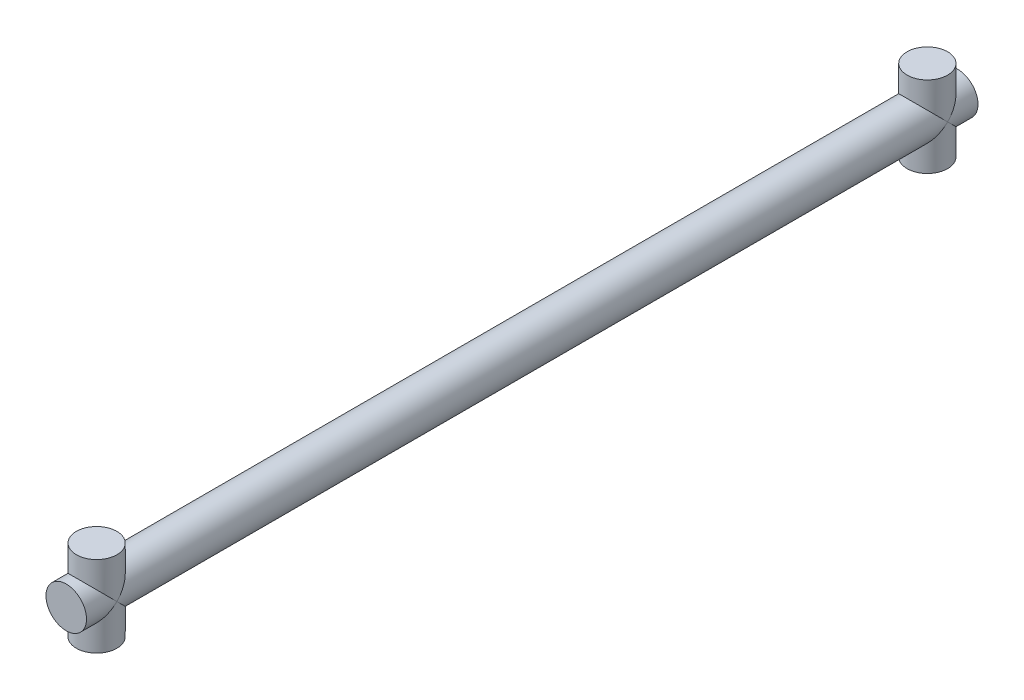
ISO-10303-21;
HEADER;
FILE_DESCRIPTION(('STEP AP214'),'2;1');
FILE_NAME('part.step','',(''),(''),'','','');
FILE_SCHEMA(('AUTOMOTIVE_DESIGN { 1 0 10303 214 1 1 1 1 }'));
ENDSEC;
DATA;
#1=APPLICATION_CONTEXT('core data for automotive mechanical design processes');
#2=APPLICATION_PROTOCOL_DEFINITION('international standard','automotive_design',2000,#1);
#3=PRODUCT_CONTEXT('',#1,'mechanical');
#4=PRODUCT('Part','Part','',(#3));
#5=PRODUCT_RELATED_PRODUCT_CATEGORY('part','',(#4));
#6=PRODUCT_DEFINITION_FORMATION('','',#4);
#7=PRODUCT_DEFINITION_CONTEXT('part definition',#1,'design');
#8=PRODUCT_DEFINITION('design','',#6,#7);
#9=PRODUCT_DEFINITION_SHAPE('','',#8);
#10=(LENGTH_UNIT() NAMED_UNIT(*) SI_UNIT(.MILLI.,.METRE.));
#11=(NAMED_UNIT(*) PLANE_ANGLE_UNIT() SI_UNIT($,.RADIAN.));
#12=(NAMED_UNIT(*) SI_UNIT($,.STERADIAN.) SOLID_ANGLE_UNIT());
#13=UNCERTAINTY_MEASURE_WITH_UNIT(LENGTH_MEASURE(1.E-05),#10,'distance_accuracy_value','');
#14=(GEOMETRIC_REPRESENTATION_CONTEXT(3) GLOBAL_UNCERTAINTY_ASSIGNED_CONTEXT((#13)) GLOBAL_UNIT_ASSIGNED_CONTEXT((#10,
#11,#12)) REPRESENTATION_CONTEXT('',''));
#15=CARTESIAN_POINT('',(0.,0.,0.));
#16=DIRECTION('',(0.,0.,1.));
#17=DIRECTION('',(1.,0.,0.));
#18=AXIS2_PLACEMENT_3D('',#15,#16,#17);
#19=CARTESIAN_POINT('',(0.,0.,55.));
#20=DIRECTION('',(0.,0.,-1.));
#21=DIRECTION('',(-1.,0.,0.));
#22=AXIS2_PLACEMENT_3D('',#19,#20,#21);
#23=CYLINDRICAL_SURFACE('',#22,2.5);
#24=CARTESIAN_POINT('',(0.,0.,-51.25));
#25=DIRECTION('',(0.,-0.707106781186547,-0.707106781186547));
#26=DIRECTION('',(0.,0.707106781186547,-0.707106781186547));
#27=AXIS2_PLACEMENT_3D('',#24,#25,#26);
#28=ELLIPSE('',#27,3.53553390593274,2.5);
#29=CARTESIAN_POINT('',(2.5,0.,-51.25));
#30=VERTEX_POINT('',#29);
#31=CARTESIAN_POINT('',(-2.5,0.,-51.25));
#32=VERTEX_POINT('',#31);
#33=EDGE_CURVE('E68',#30,#32,#28,.T.);
#34=ORIENTED_EDGE('',*,*,#33,.F.);
#35=CARTESIAN_POINT('',(0.,0.,-51.25));
#36=DIRECTION('',(0.,0.707106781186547,-0.707106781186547));
#37=DIRECTION('',(0.,-0.707106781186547,-0.707106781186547));
#38=AXIS2_PLACEMENT_3D('',#35,#36,#37);
#39=ELLIPSE('',#38,3.53553390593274,2.5);
#40=EDGE_CURVE('E64',#32,#30,#39,.T.);
#41=ORIENTED_EDGE('',*,*,#40,.F.);
#42=EDGE_LOOP('',(#34,#41));
#43=FACE_BOUND('',#42,.T.);
#44=CARTESIAN_POINT('',(0.,0.,51.25));
#45=DIRECTION('',(0.,-0.707106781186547,-0.707106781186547));
#46=DIRECTION('',(0.,0.707106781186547,-0.707106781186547));
#47=AXIS2_PLACEMENT_3D('',#44,#45,#46);
#48=ELLIPSE('',#47,3.53553390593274,2.5);
#49=CARTESIAN_POINT('',(2.5,0.,51.25));
#50=VERTEX_POINT('',#49);
#51=CARTESIAN_POINT('',(-2.5,0.,51.25));
#52=VERTEX_POINT('',#51);
#53=EDGE_CURVE('E11',#50,#52,#48,.F.);
#54=ORIENTED_EDGE('',*,*,#53,.F.);
#55=CARTESIAN_POINT('',(0.,0.,51.25));
#56=DIRECTION('',(0.,0.707106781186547,-0.707106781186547));
#57=DIRECTION('',(0.,-0.707106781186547,-0.707106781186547));
#58=AXIS2_PLACEMENT_3D('',#55,#56,#57);
#59=ELLIPSE('',#58,3.53553390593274,2.5);
#60=EDGE_CURVE('E48',#52,#50,#59,.F.);
#61=ORIENTED_EDGE('',*,*,#60,.F.);
#62=EDGE_LOOP('',(#54,#61));
#63=FACE_BOUND('',#62,.T.);
#64=ADVANCED_FACE('F34',(#43,#63),#23,.T.);
#65=CARTESIAN_POINT('',(0.,-5.,-51.25));
#66=DIRECTION('',(0.,1.,0.));
#67=DIRECTION('',(0.,0.,1.));
#68=AXIS2_PLACEMENT_3D('',#65,#66,#67);
#69=PLANE('',#68);
#70=CARTESIAN_POINT('',(0.,-5.,-51.25));
#71=DIRECTION('',(0.,1.,0.));
#72=DIRECTION('',(0.,0.,1.));
#73=AXIS2_PLACEMENT_3D('',#70,#71,#72);
#74=CIRCLE('',#73,2.5);
#75=CARTESIAN_POINT('',(0.,-5.,-48.75));
#76=VERTEX_POINT('',#75);
#77=EDGE_CURVE('E118',#76,#76,#74,.T.);
#78=ORIENTED_EDGE('',*,*,#77,.F.);
#79=EDGE_LOOP('',(#78));
#80=FACE_BOUND('',#79,.T.);
#81=ADVANCED_FACE('F89',(#80),#69,.F.);
#82=CARTESIAN_POINT('',(0.,5.,-51.25));
#83=DIRECTION('',(0.,-1.,0.));
#84=DIRECTION('',(0.,0.,-1.));
#85=AXIS2_PLACEMENT_3D('',#82,#83,#84);
#86=CYLINDRICAL_SURFACE('',#85,2.5);
#87=ORIENTED_EDGE('',*,*,#77,.T.);
#88=EDGE_LOOP('',(#87));
#89=FACE_BOUND('',#88,.T.);
#90=CARTESIAN_POINT('',(0.,0.,-51.25));
#91=DIRECTION('',(0.,0.707106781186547,-0.707106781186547));
#92=DIRECTION('',(0.,-0.707106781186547,-0.707106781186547));
#93=AXIS2_PLACEMENT_3D('',#90,#91,#92);
#94=ELLIPSE('',#93,3.53553390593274,2.5);
#95=EDGE_CURVE('E71',#32,#30,#94,.F.);
#96=ORIENTED_EDGE('',*,*,#95,.T.);
#97=ORIENTED_EDGE('',*,*,#33,.T.);
#98=EDGE_LOOP('',(#96,#97));
#99=FACE_BOUND('',#98,.T.);
#100=ADVANCED_FACE('F79',(#89,#99),#86,.T.);
#101=CARTESIAN_POINT('',(0.,0.,-55.));
#102=DIRECTION('',(0.,0.,1.));
#103=DIRECTION('',(1.,0.,0.));
#104=AXIS2_PLACEMENT_3D('',#101,#102,#103);
#105=PLANE('',#104);
#106=CARTESIAN_POINT('',(0.,0.,-55.));
#107=DIRECTION('',(0.,0.,1.));
#108=DIRECTION('',(1.,0.,0.));
#109=AXIS2_PLACEMENT_3D('',#106,#107,#108);
#110=CIRCLE('',#109,2.5);
#111=CARTESIAN_POINT('',(2.5,0.,-55.));
#112=VERTEX_POINT('',#111);
#113=EDGE_CURVE('E112',#112,#112,#110,.T.);
#114=ORIENTED_EDGE('',*,*,#113,.F.);
#115=EDGE_LOOP('',(#114));
#116=FACE_BOUND('',#115,.T.);
#117=ADVANCED_FACE('F100',(#116),#105,.F.);
#118=ORIENTED_EDGE('',*,*,#113,.T.);
#119=EDGE_LOOP('',(#118));
#120=FACE_BOUND('',#119,.T.);
#121=CARTESIAN_POINT('',(0.,0.,-51.25));
#122=DIRECTION('',(0.,-0.707106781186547,-0.707106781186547));
#123=DIRECTION('',(0.,0.707106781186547,-0.707106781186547));
#124=AXIS2_PLACEMENT_3D('',#121,#122,#123);
#125=ELLIPSE('',#124,3.53553390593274,2.5);
#126=EDGE_CURVE('E75',#30,#32,#125,.F.);
#127=ORIENTED_EDGE('',*,*,#126,.F.);
#128=ORIENTED_EDGE('',*,*,#95,.F.);
#129=EDGE_LOOP('',(#127,#128));
#130=FACE_BOUND('',#129,.T.);
#131=ADVANCED_FACE('F36',(#120,#130),#23,.T.);
#132=CARTESIAN_POINT('',(0.,5.,-51.25));
#133=DIRECTION('',(0.,1.,0.));
#134=DIRECTION('',(0.,0.,1.));
#135=AXIS2_PLACEMENT_3D('',#132,#133,#134);
#136=CIRCLE('',#135,2.5);
#137=CARTESIAN_POINT('',(0.,5.,-48.75));
#138=VERTEX_POINT('',#137);
#139=EDGE_CURVE('E113',#138,#138,#136,.T.);
#140=ORIENTED_EDGE('',*,*,#139,.F.);
#141=EDGE_LOOP('',(#140));
#142=FACE_BOUND('',#141,.T.);
#143=ORIENTED_EDGE('',*,*,#40,.T.);
#144=ORIENTED_EDGE('',*,*,#126,.T.);
#145=EDGE_LOOP('',(#143,#144));
#146=FACE_BOUND('',#145,.T.);
#147=ADVANCED_FACE('F81',(#142,#146),#86,.T.);
#148=CARTESIAN_POINT('',(0.,5.,-51.25));
#149=DIRECTION('',(0.,1.,0.));
#150=DIRECTION('',(0.,0.,1.));
#151=AXIS2_PLACEMENT_3D('',#148,#149,#150);
#152=PLANE('',#151);
#153=ORIENTED_EDGE('',*,*,#139,.T.);
#154=EDGE_LOOP('',(#153));
#155=FACE_BOUND('',#154,.T.);
#156=ADVANCED_FACE('F106',(#155),#152,.T.);
#157=CARTESIAN_POINT('',(0.,-5.,51.25));
#158=DIRECTION('',(0.,1.,0.));
#159=DIRECTION('',(0.,0.,1.));
#160=AXIS2_PLACEMENT_3D('',#157,#158,#159);
#161=PLANE('',#160);
#162=CARTESIAN_POINT('',(0.,-5.,51.25));
#163=DIRECTION('',(0.,1.,0.));
#164=DIRECTION('',(0.,0.,1.));
#165=AXIS2_PLACEMENT_3D('',#162,#163,#164);
#166=CIRCLE('',#165,2.5);
#167=CARTESIAN_POINT('',(0.,-5.,53.75));
#168=VERTEX_POINT('',#167);
#169=EDGE_CURVE('E124',#168,#168,#166,.T.);
#170=ORIENTED_EDGE('',*,*,#169,.F.);
#171=EDGE_LOOP('',(#170));
#172=FACE_BOUND('',#171,.T.);
#173=ADVANCED_FACE('F139',(#172),#161,.F.);
#174=CARTESIAN_POINT('',(0.,5.,51.25));
#175=DIRECTION('',(0.,-1.,0.));
#176=DIRECTION('',(0.,0.,-1.));
#177=AXIS2_PLACEMENT_3D('',#174,#175,#176);
#178=CYLINDRICAL_SURFACE('',#177,2.5);
#179=ORIENTED_EDGE('',*,*,#169,.T.);
#180=EDGE_LOOP('',(#179));
#181=FACE_BOUND('',#180,.T.);
#182=ORIENTED_EDGE('',*,*,#60,.T.);
#183=CARTESIAN_POINT('',(0.,0.,51.25));
#184=DIRECTION('',(0.,-0.707106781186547,-0.707106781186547));
#185=DIRECTION('',(0.,0.707106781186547,-0.707106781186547));
#186=AXIS2_PLACEMENT_3D('',#183,#184,#185);
#187=ELLIPSE('',#186,3.53553390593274,2.5);
#188=EDGE_CURVE('E42',#50,#52,#187,.T.);
#189=ORIENTED_EDGE('',*,*,#188,.T.);
#190=EDGE_LOOP('',(#182,#189));
#191=FACE_BOUND('',#190,.T.);
#192=ADVANCED_FACE('F85',(#181,#191),#178,.T.);
#193=CARTESIAN_POINT('',(0.,5.,51.25));
#194=DIRECTION('',(0.,1.,0.));
#195=DIRECTION('',(0.,0.,1.));
#196=AXIS2_PLACEMENT_3D('',#193,#194,#195);
#197=CIRCLE('',#196,2.5);
#198=CARTESIAN_POINT('',(0.,5.,53.75));
#199=VERTEX_POINT('',#198);
#200=EDGE_CURVE('E122',#199,#199,#197,.T.);
#201=ORIENTED_EDGE('',*,*,#200,.F.);
#202=EDGE_LOOP('',(#201));
#203=FACE_BOUND('',#202,.T.);
#204=CARTESIAN_POINT('',(0.,0.,51.25));
#205=DIRECTION('',(0.,0.707106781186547,-0.707106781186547));
#206=DIRECTION('',(0.,-0.707106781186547,-0.707106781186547));
#207=AXIS2_PLACEMENT_3D('',#204,#205,#206);
#208=ELLIPSE('',#207,3.53553390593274,2.5);
#209=EDGE_CURVE('E55',#52,#50,#208,.T.);
#210=ORIENTED_EDGE('',*,*,#209,.T.);
#211=ORIENTED_EDGE('',*,*,#53,.T.);
#212=EDGE_LOOP('',(#210,#211));
#213=FACE_BOUND('',#212,.T.);
#214=ADVANCED_FACE('F87',(#203,#213),#178,.T.);
#215=CARTESIAN_POINT('',(0.,5.,51.25));
#216=DIRECTION('',(0.,1.,0.));
#217=DIRECTION('',(0.,0.,1.));
#218=AXIS2_PLACEMENT_3D('',#215,#216,#217);
#219=PLANE('',#218);
#220=ORIENTED_EDGE('',*,*,#200,.T.);
#221=EDGE_LOOP('',(#220));
#222=FACE_BOUND('',#221,.T.);
#223=ADVANCED_FACE('F130',(#222),#219,.T.);
#224=CARTESIAN_POINT('',(0.,0.,55.));
#225=DIRECTION('',(0.,0.,1.));
#226=DIRECTION('',(1.,0.,0.));
#227=AXIS2_PLACEMENT_3D('',#224,#225,#226);
#228=PLANE('',#227);
#229=CARTESIAN_POINT('',(0.,0.,55.));
#230=DIRECTION('',(0.,0.,1.));
#231=DIRECTION('',(1.,0.,0.));
#232=AXIS2_PLACEMENT_3D('',#229,#230,#231);
#233=CIRCLE('',#232,2.5);
#234=CARTESIAN_POINT('',(2.5,0.,55.));
#235=VERTEX_POINT('',#234);
#236=EDGE_CURVE('E77',#235,#235,#233,.T.);
#237=ORIENTED_EDGE('',*,*,#236,.T.);
#238=EDGE_LOOP('',(#237));
#239=FACE_BOUND('',#238,.T.);
#240=ADVANCED_FACE('F97',(#239),#228,.T.);
#241=ORIENTED_EDGE('',*,*,#236,.F.);
#242=EDGE_LOOP('',(#241));
#243=FACE_BOUND('',#242,.T.);
#244=ORIENTED_EDGE('',*,*,#188,.F.);
#245=ORIENTED_EDGE('',*,*,#209,.F.);
#246=EDGE_LOOP('',(#244,#245));
#247=FACE_BOUND('',#246,.T.);
#248=ADVANCED_FACE('F90',(#243,#247),#23,.T.);
#249=CLOSED_SHELL('',(#64,#81,#100,#117,#131,#147,#156,#173,#192,#214,#223,#240,#248));
#250=MANIFOLD_SOLID_BREP('B2',#249);
#251=ADVANCED_BREP_SHAPE_REPRESENTATION('',(#18,#250),#14);
#252=SHAPE_DEFINITION_REPRESENTATION(#9,#251);
ENDSEC;
END-ISO-10303-21;
